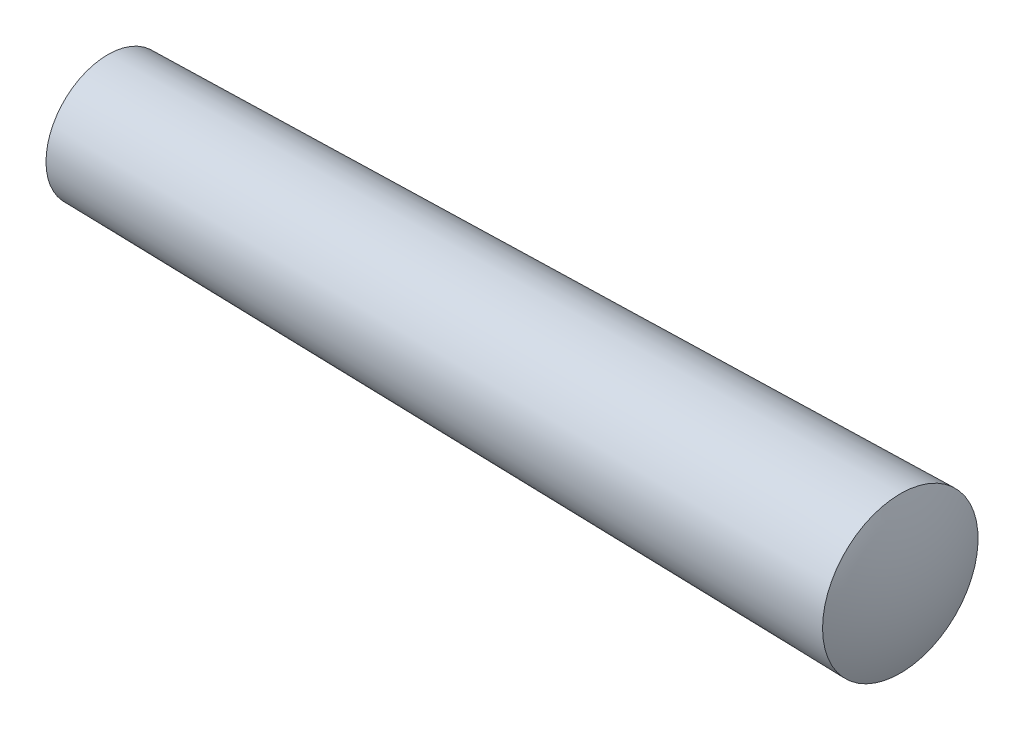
ISO-10303-21;
HEADER;
FILE_DESCRIPTION(('STEP AP214'),'2;1');
FILE_NAME('part.step','',(''),(''),'','','');
FILE_SCHEMA(('AUTOMOTIVE_DESIGN { 1 0 10303 214 1 1 1 1 }'));
ENDSEC;
DATA;
#1=APPLICATION_CONTEXT('core data for automotive mechanical design processes');
#2=APPLICATION_PROTOCOL_DEFINITION('international standard','automotive_design',2000,#1);
#3=PRODUCT_CONTEXT('',#1,'mechanical');
#4=PRODUCT('Part','Part','',(#3));
#5=PRODUCT_RELATED_PRODUCT_CATEGORY('part','',(#4));
#6=PRODUCT_DEFINITION_FORMATION('','',#4);
#7=PRODUCT_DEFINITION_CONTEXT('part definition',#1,'design');
#8=PRODUCT_DEFINITION('design','',#6,#7);
#9=PRODUCT_DEFINITION_SHAPE('','',#8);
#10=(LENGTH_UNIT() NAMED_UNIT(*) SI_UNIT(.MILLI.,.METRE.));
#11=(NAMED_UNIT(*) PLANE_ANGLE_UNIT() SI_UNIT($,.RADIAN.));
#12=(NAMED_UNIT(*) SI_UNIT($,.STERADIAN.) SOLID_ANGLE_UNIT());
#13=UNCERTAINTY_MEASURE_WITH_UNIT(LENGTH_MEASURE(1.E-05),#10,'distance_accuracy_value','');
#14=(GEOMETRIC_REPRESENTATION_CONTEXT(3) GLOBAL_UNCERTAINTY_ASSIGNED_CONTEXT((#13)) GLOBAL_UNIT_ASSIGNED_CONTEXT((#10,
#11,#12)) REPRESENTATION_CONTEXT('',''));
#15=CARTESIAN_POINT('',(0.,0.,0.));
#16=DIRECTION('',(0.,0.,1.));
#17=DIRECTION('',(1.,0.,0.));
#18=AXIS2_PLACEMENT_3D('',#15,#16,#17);
#19=CARTESIAN_POINT('',(0.602499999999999,0.,0.));
#20=DIRECTION('',(-1.,0.,0.));
#21=DIRECTION('',(0.,1.,0.));
#22=AXIS2_PLACEMENT_3D('',#19,#20,#21);
#23=SPHERICAL_SURFACE('',#22,0.602499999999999);
#24=CARTESIAN_POINT('',(0.0799999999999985,0.,0.));
#25=DIRECTION('',(-1.,0.,0.));
#26=DIRECTION('',(0.,0.,1.));
#27=AXIS2_PLACEMENT_3D('',#24,#25,#26);
#28=CIRCLE('',#27,0.3);
#29=CARTESIAN_POINT('',(0.0799999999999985,0.,0.3));
#30=VERTEX_POINT('',#29);
#31=EDGE_CURVE('E34',#30,#30,#28,.T.);
#32=ORIENTED_EDGE('',*,*,#31,.T.);
#33=EDGE_LOOP('',(#32));
#34=FACE_BOUND('',#33,.T.);
#35=ADVANCED_FACE('F28',(#34),#23,.T.);
#36=CARTESIAN_POINT('',(3.072636,0.,0.));
#37=DIRECTION('',(-1.,0.,0.));
#38=DIRECTION('',(0.,1.,0.));
#39=AXIS2_PLACEMENT_3D('',#36,#37,#38);
#40=SPHERICAL_SURFACE('',#39,0.927363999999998);
#41=CARTESIAN_POINT('',(3.92,0.,0.));
#42=DIRECTION('',(-1.,0.,0.));
#43=DIRECTION('',(0.,0.,1.));
#44=AXIS2_PLACEMENT_3D('',#41,#42,#43);
#45=CIRCLE('',#44,0.3768);
#46=CARTESIAN_POINT('',(3.92,0.,0.3768));
#47=VERTEX_POINT('',#46);
#48=EDGE_CURVE('E10',#47,#47,#45,.T.);
#49=ORIENTED_EDGE('',*,*,#48,.F.);
#50=EDGE_LOOP('',(#49));
#51=FACE_BOUND('',#50,.T.);
#52=ADVANCED_FACE('F43',(#51),#40,.T.);
#53=CARTESIAN_POINT('',(3.92,0.,0.));
#54=DIRECTION('',(1.,0.,0.));
#55=DIRECTION('',(0.,0.,-1.));
#56=AXIS2_PLACEMENT_3D('',#53,#54,#55);
#57=CONICAL_SURFACE('',#56,0.3768,0.0199973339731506);
#58=ORIENTED_EDGE('',*,*,#31,.F.);
#59=EDGE_LOOP('',(#58));
#60=FACE_BOUND('',#59,.T.);
#61=ORIENTED_EDGE('',*,*,#48,.T.);
#62=EDGE_LOOP('',(#61));
#63=FACE_BOUND('',#62,.T.);
#64=ADVANCED_FACE('F41',(#60,#63),#57,.T.);
#65=CLOSED_SHELL('',(#35,#52,#64));
#66=MANIFOLD_SOLID_BREP('B2',#65);
#67=ADVANCED_BREP_SHAPE_REPRESENTATION('',(#18,#66),#14);
#68=SHAPE_DEFINITION_REPRESENTATION(#9,#67);
ENDSEC;
END-ISO-10303-21;
